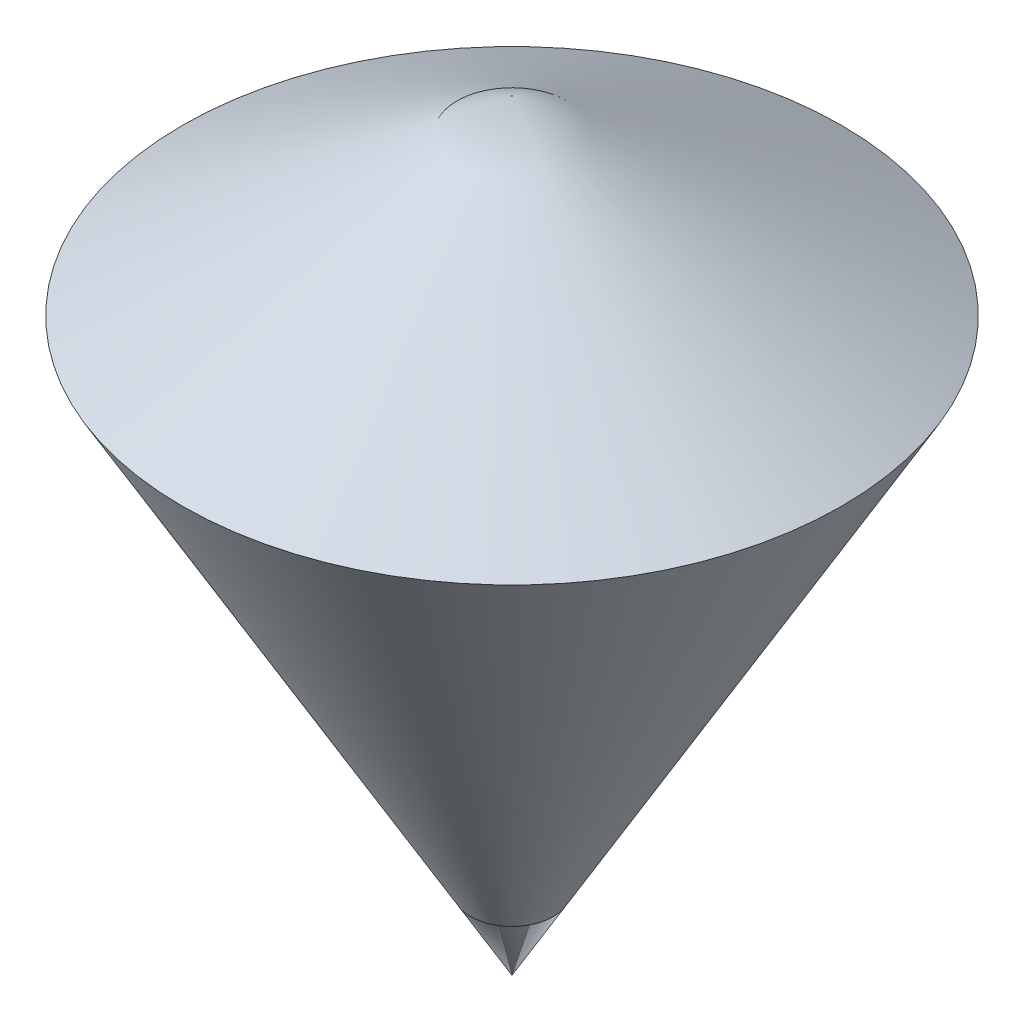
from build123d import *


with BuildPart() as part:
    # Sketch2 → Revolve1 (revolve)
    with BuildSketch(Plane.XY, mode=Mode.PRIVATE) as revolve1_sk:
        Polygon((0, 0), (-17.320508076, 30), (0, 40), align=None)
    revolve(revolve1_sk.sketch.rotate(Axis((0, 40, 0), (0, -1, 0)), 180), axis=Axis((0, 40, 0), (0, -1, 0)))


solid = part.part
